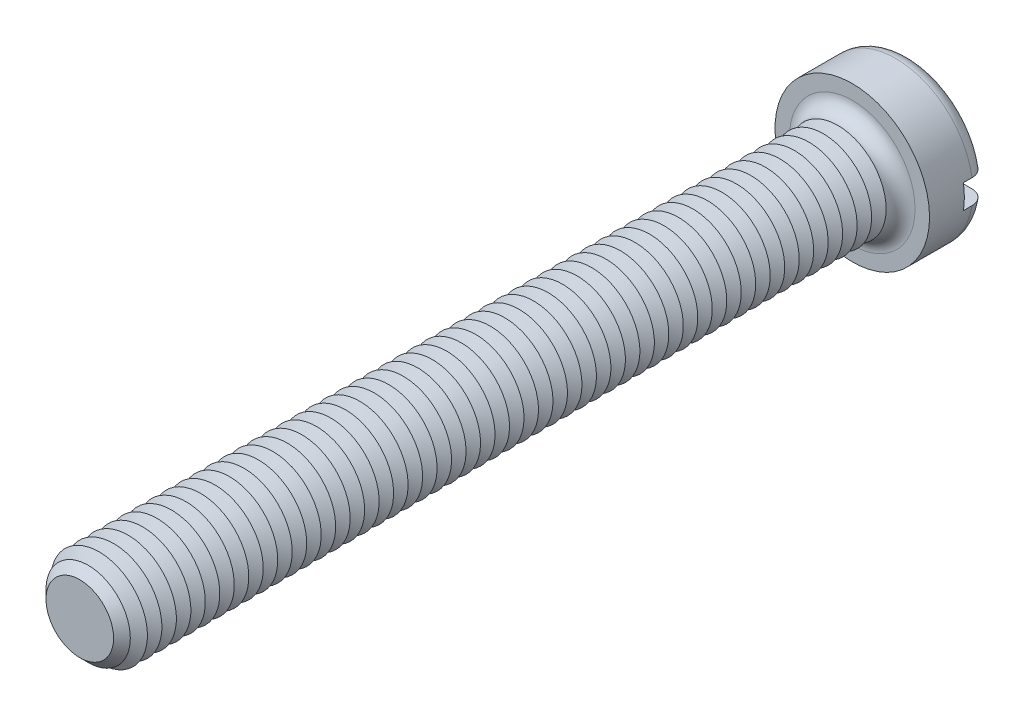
from build123d import *

# Parameters (mm, degrees)
SKETCH3_R           = 8
BOSS_EXTRUDE2_DEPTH = 6
SKETCH4_R           = 5
BOSS_EXTRUDE3_DEPTH = 80
FILLET1_R           = 1.5
CHAMFER1_SIZE       = 1.5
LPATTERN1_COUNT     = 52
LPATTERN1_PITCH     = 1.5
SKETCH8_W           = 16
SKETCH8_H           = 2.5
CUT_EXTRUDE1_DEPTH  = 2.4


with BuildPart() as part:
    # Sketch3 → Boss-Extrude2 (new body)
    with BuildSketch(Plane.XY):
        Circle(SKETCH3_R)
    extrude(amount=-BOSS_EXTRUDE2_DEPTH)

    # Sketch4 → Boss-Extrude3 (add)
    with BuildSketch(Plane.XY):
        Circle(SKETCH4_R)
    extrude(amount=BOSS_EXTRUDE3_DEPTH)

    # Fillet1
    fillet1_edges = [part.edges().sort_by_distance(p)[0] for p in [
        (-8, 0, -6),
        (-5, 0, 0),
    ]]
    fillet(fillet1_edges, radius=FILLET1_R)

    # Chamfer1
    chamfer1_edges = [part.edges().sort_by_distance(p)[0] for p in [
        (-5, 0, 80),
    ]]
    chamfer(chamfer1_edges, length=CHAMFER1_SIZE)

    # Sketch6 → Cut-Revolve1 (revolve, cut)
    with BuildSketch(Plane(origin=(0, 0, 0), x_dir=(0, 0, -1), z_dir=(1, 0, 0)), mode=Mode.PRIVATE) as cut_revolve1_sk:
        Polygon((-1.5, 5), (-2.25, 3.700961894), (-3, 5), align=None)
    cut_revolve1 = revolve(cut_revolve1_sk.sketch.rotate(Axis((0, 0, -1.694361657), (0, 0, 1)), 90), axis=Axis((0, 0, -1.694361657), (0, 0, 1)), mode=Mode.SUBTRACT)

    # LPattern1: Cut-Revolve1 ×52
    with Locations(*[(0, 0, i * LPATTERN1_PITCH) for i in range(1, LPATTERN1_COUNT)]):
        add(cut_revolve1, mode=Mode.SUBTRACT)

    # Sketch8 → Cut-Extrude1 (cut)
    with BuildSketch(Plane(origin=(0, 0, -6), x_dir=(-1, 0, 0), z_dir=(0, 0, -1))):
        Rectangle(SKETCH8_W, SKETCH8_H)
    extrude(amount=-CUT_EXTRUDE1_DEPTH, mode=Mode.SUBTRACT)


solid = part.part
